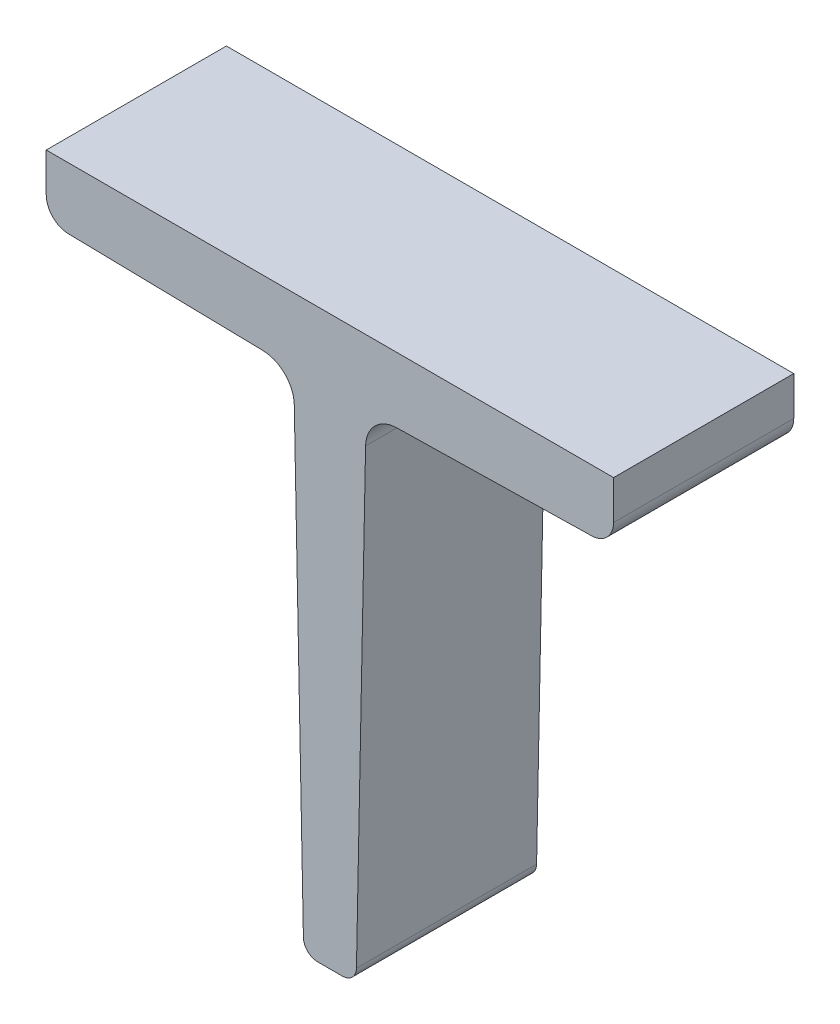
ISO-10303-21;
HEADER;
FILE_DESCRIPTION(('STEP AP214'),'2;1');
FILE_NAME('part.step','',(''),(''),'','','');
FILE_SCHEMA(('AUTOMOTIVE_DESIGN { 1 0 10303 214 1 1 1 1 }'));
ENDSEC;
DATA;
#1=APPLICATION_CONTEXT('core data for automotive mechanical design processes');
#2=APPLICATION_PROTOCOL_DEFINITION('international standard','automotive_design',2000,#1);
#3=PRODUCT_CONTEXT('',#1,'mechanical');
#4=PRODUCT('Part','Part','',(#3));
#5=PRODUCT_RELATED_PRODUCT_CATEGORY('part','',(#4));
#6=PRODUCT_DEFINITION_FORMATION('','',#4);
#7=PRODUCT_DEFINITION_CONTEXT('part definition',#1,'design');
#8=PRODUCT_DEFINITION('design','',#6,#7);
#9=PRODUCT_DEFINITION_SHAPE('','',#8);
#10=(LENGTH_UNIT() NAMED_UNIT(*) SI_UNIT(.MILLI.,.METRE.));
#11=(NAMED_UNIT(*) PLANE_ANGLE_UNIT() SI_UNIT($,.RADIAN.));
#12=(NAMED_UNIT(*) SI_UNIT($,.STERADIAN.) SOLID_ANGLE_UNIT());
#13=UNCERTAINTY_MEASURE_WITH_UNIT(LENGTH_MEASURE(1.E-05),#10,'distance_accuracy_value','');
#14=(GEOMETRIC_REPRESENTATION_CONTEXT(3) GLOBAL_UNCERTAINTY_ASSIGNED_CONTEXT((#13)) GLOBAL_UNIT_ASSIGNED_CONTEXT((#10,
#11,#12)) REPRESENTATION_CONTEXT('',''));
#15=CARTESIAN_POINT('',(0.,0.,0.));
#16=DIRECTION('',(0.,0.,1.));
#17=DIRECTION('',(1.,0.,0.));
#18=AXIS2_PLACEMENT_3D('',#15,#16,#17);
#19=CARTESIAN_POINT('',(0.,0.,12.7));
#20=DIRECTION('',(1.,0.,0.));
#21=DIRECTION('',(0.,1.,0.));
#22=AXIS2_PLACEMENT_3D('',#19,#20,#21);
#23=PLANE('',#22);
#24=DIRECTION('',(0.,-1.,0.));
#25=VECTOR('',#24,1.);
#26=CARTESIAN_POINT('',(0.,0.,-12.7));
#27=LINE('',#26,#25);
#28=CARTESIAN_POINT('',(0.,0.,-12.7));
#29=VERTEX_POINT('',#28);
#30=CARTESIAN_POINT('',(0.,-5.48779513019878,-12.7));
#31=VERTEX_POINT('',#30);
#32=EDGE_CURVE('E166',#29,#31,#27,.T.);
#33=ORIENTED_EDGE('',*,*,#32,.T.);
#34=DIRECTION('',(0.,0.,-1.));
#35=VECTOR('',#34,1.);
#36=CARTESIAN_POINT('',(0.,-5.48779513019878,12.7));
#37=LINE('',#36,#35);
#38=CARTESIAN_POINT('',(0.,-5.48779513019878,12.7));
#39=VERTEX_POINT('',#38);
#40=EDGE_CURVE('E212',#31,#39,#37,.F.);
#41=ORIENTED_EDGE('',*,*,#40,.T.);
#42=DIRECTION('',(0.,-1.,0.));
#43=VECTOR('',#42,1.);
#44=CARTESIAN_POINT('',(0.,0.,12.7));
#45=LINE('',#44,#43);
#46=CARTESIAN_POINT('',(0.,0.,12.7));
#47=VERTEX_POINT('',#46);
#48=EDGE_CURVE('E184',#47,#39,#45,.T.);
#49=ORIENTED_EDGE('',*,*,#48,.F.);
#50=DIRECTION('',(0.,0.,-1.));
#51=VECTOR('',#50,1.);
#52=CARTESIAN_POINT('',(0.,0.,12.7));
#53=LINE('',#52,#51);
#54=EDGE_CURVE('E149',#47,#29,#53,.T.);
#55=ORIENTED_EDGE('',*,*,#54,.T.);
#56=EDGE_LOOP('',(#33,#41,#49,#55));
#57=FACE_BOUND('',#56,.T.);
#58=ADVANCED_FACE('F32',(#57),#23,.F.);
#59=CARTESIAN_POINT('',(34.8858284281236,-9.29777820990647,12.7));
#60=DIRECTION('',(-0.0200001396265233,-0.9997999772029,0.));
#61=DIRECTION('',(0.9997999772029,-0.0200001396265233,0.));
#62=AXIS2_PLACEMENT_3D('',#59,#60,#61);
#63=PLANE('',#62);
#64=DIRECTION('',(-0.9997999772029,0.0200001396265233,0.));
#65=VECTOR('',#64,1.);
#66=CARTESIAN_POINT('',(34.8858284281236,-9.29777820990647,12.7));
#67=LINE('',#66,#65);
#68=CARTESIAN_POINT('',(30.5631996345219,-9.21130773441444,12.7));
#69=VERTEX_POINT('',#68);
#70=CARTESIAN_POINT('',(3.11149955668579,-8.66216005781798,12.7));
#71=VERTEX_POINT('',#70);
#72=EDGE_CURVE('E259',#69,#71,#67,.T.);
#73=ORIENTED_EDGE('',*,*,#72,.T.);
#74=DIRECTION('',(0.,0.,-1.));
#75=VECTOR('',#74,1.);
#76=CARTESIAN_POINT('',(3.11149955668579,-8.66216005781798,-12.7));
#77=LINE('',#76,#75);
#78=CARTESIAN_POINT('',(3.11149955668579,-8.66216005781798,-12.7));
#79=VERTEX_POINT('',#78);
#80=EDGE_CURVE('E205',#71,#79,#77,.T.);
#81=ORIENTED_EDGE('',*,*,#80,.T.);
#82=DIRECTION('',(-0.9997999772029,0.0200001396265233,0.));
#83=VECTOR('',#82,1.);
#84=CARTESIAN_POINT('',(34.8858284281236,-9.29777820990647,-12.7));
#85=LINE('',#84,#83);
#86=CARTESIAN_POINT('',(30.5631996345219,-9.21130773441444,-12.7));
#87=VERTEX_POINT('',#86);
#88=EDGE_CURVE('E169',#87,#79,#85,.T.);
#89=ORIENTED_EDGE('',*,*,#88,.F.);
#90=DIRECTION('',(0.,0.,-1.));
#91=VECTOR('',#90,1.);
#92=CARTESIAN_POINT('',(30.5631996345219,-9.21130773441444,12.7));
#93=LINE('',#92,#91);
#94=EDGE_CURVE('E188',#87,#69,#93,.F.);
#95=ORIENTED_EDGE('',*,*,#94,.T.);
#96=EDGE_LOOP('',(#73,#81,#89,#95));
#97=FACE_BOUND('',#96,.T.);
#98=ADVANCED_FACE('F256',(#97),#63,.T.);
#99=CARTESIAN_POINT('',(36.3001656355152,-80.,12.7));
#100=DIRECTION('',(-0.9997999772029,-0.0200001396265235,0.));
#101=DIRECTION('',(0.0200001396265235,-0.9997999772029,0.));
#102=AXIS2_PLACEMENT_3D('',#99,#100,#101);
#103=PLANE('',#102);
#104=DIRECTION('',(-0.0200001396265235,0.9997999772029,0.));
#105=VECTOR('',#104,1.);
#106=CARTESIAN_POINT('',(36.3001656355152,-80.,-12.7));
#107=LINE('',#106,#105);
#108=CARTESIAN_POINT('',(36.2609575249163,-78.0400002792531,-12.7));
#109=VERTEX_POINT('',#108);
#110=CARTESIAN_POINT('',(34.9722989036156,-13.6204070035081,-12.7));
#111=VERTEX_POINT('',#110);
#112=EDGE_CURVE('E172',#109,#111,#107,.T.);
#113=ORIENTED_EDGE('',*,*,#112,.F.);
#114=DIRECTION('',(0.,0.,-1.));
#115=VECTOR('',#114,1.);
#116=CARTESIAN_POINT('',(36.2609575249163,-78.0400002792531,12.7));
#117=LINE('',#116,#115);
#118=CARTESIAN_POINT('',(36.2609575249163,-78.0400002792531,12.7));
#119=VERTEX_POINT('',#118);
#120=EDGE_CURVE('E55',#109,#119,#117,.F.);
#121=ORIENTED_EDGE('',*,*,#120,.T.);
#122=DIRECTION('',(-0.0200001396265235,0.9997999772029,0.));
#123=VECTOR('',#122,1.);
#124=CARTESIAN_POINT('',(36.3001656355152,-80.,12.7));
#125=LINE('',#124,#123);
#126=CARTESIAN_POINT('',(34.9722989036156,-13.6204070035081,12.7));
#127=VERTEX_POINT('',#126);
#128=EDGE_CURVE('E234',#119,#127,#125,.T.);
#129=ORIENTED_EDGE('',*,*,#128,.T.);
#130=DIRECTION('',(0.,0.,-1.));
#131=VECTOR('',#130,1.);
#132=CARTESIAN_POINT('',(34.9722989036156,-13.6204070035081,-12.7));
#133=LINE('',#132,#131);
#134=EDGE_CURVE('E148',#127,#111,#133,.T.);
#135=ORIENTED_EDGE('',*,*,#134,.T.);
#136=EDGE_LOOP('',(#113,#121,#129,#135));
#137=FACE_BOUND('',#136,.T.);
#138=ADVANCED_FACE('F247',(#137),#103,.T.);
#139=CARTESIAN_POINT('',(36.3001656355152,-80.,12.7));
#140=DIRECTION('',(0.,1.,0.));
#141=DIRECTION('',(0.,0.,1.));
#142=AXIS2_PLACEMENT_3D('',#139,#140,#141);
#143=PLANE('',#142);
#144=DIRECTION('',(1.,0.,0.));
#145=VECTOR('',#144,1.);
#146=CARTESIAN_POINT('',(36.3001656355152,-80.,12.7));
#147=LINE('',#146,#145);
#148=CARTESIAN_POINT('',(38.2605574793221,-80.,12.7));
#149=VERTEX_POINT('',#148);
#150=CARTESIAN_POINT('',(41.7394425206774,-80.,12.7));
#151=VERTEX_POINT('',#150);
#152=EDGE_CURVE('E233',#149,#151,#147,.T.);
#153=ORIENTED_EDGE('',*,*,#152,.F.);
#154=DIRECTION('',(0.,0.,-1.));
#155=VECTOR('',#154,1.);
#156=CARTESIAN_POINT('',(38.2605574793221,-80.,-12.7));
#157=LINE('',#156,#155);
#158=CARTESIAN_POINT('',(38.2605574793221,-80.,-12.7));
#159=VERTEX_POINT('',#158);
#160=EDGE_CURVE('E223',#149,#159,#157,.T.);
#161=ORIENTED_EDGE('',*,*,#160,.T.);
#162=DIRECTION('',(1.,0.,0.));
#163=VECTOR('',#162,1.);
#164=CARTESIAN_POINT('',(36.3001656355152,-80.,-12.7));
#165=LINE('',#164,#163);
#166=CARTESIAN_POINT('',(41.7394425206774,-80.,-12.7));
#167=VERTEX_POINT('',#166);
#168=EDGE_CURVE('E174',#159,#167,#165,.T.);
#169=ORIENTED_EDGE('',*,*,#168,.T.);
#170=DIRECTION('',(0.,0.,-1.));
#171=VECTOR('',#170,1.);
#172=CARTESIAN_POINT('',(41.7394425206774,-80.,12.7));
#173=LINE('',#172,#171);
#174=EDGE_CURVE('E221',#167,#151,#173,.F.);
#175=ORIENTED_EDGE('',*,*,#174,.T.);
#176=EDGE_LOOP('',(#153,#161,#169,#175));
#177=FACE_BOUND('',#176,.T.);
#178=ADVANCED_FACE('F238',(#177),#143,.F.);
#179=CARTESIAN_POINT('',(45.1141715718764,-9.29777820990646,12.7));
#180=DIRECTION('',(0.9997999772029,-0.0200001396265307,0.));
#181=DIRECTION('',(0.0200001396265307,0.9997999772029,0.));
#182=AXIS2_PLACEMENT_3D('',#179,#180,#181);
#183=PLANE('',#182);
#184=DIRECTION('',(-0.0200001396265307,-0.9997999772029,0.));
#185=VECTOR('',#184,1.);
#186=CARTESIAN_POINT('',(45.1141715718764,-9.29777820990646,12.7));
#187=LINE('',#186,#185);
#188=CARTESIAN_POINT('',(45.0277010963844,-13.6204070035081,12.7));
#189=VERTEX_POINT('',#188);
#190=CARTESIAN_POINT('',(43.7390424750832,-78.0400002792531,12.7));
#191=VERTEX_POINT('',#190);
#192=EDGE_CURVE('E241',#189,#191,#187,.T.);
#193=ORIENTED_EDGE('',*,*,#192,.T.);
#194=DIRECTION('',(0.,0.,-1.));
#195=VECTOR('',#194,1.);
#196=CARTESIAN_POINT('',(43.7390424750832,-78.0400002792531,-12.7));
#197=LINE('',#196,#195);
#198=CARTESIAN_POINT('',(43.7390424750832,-78.0400002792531,-12.7));
#199=VERTEX_POINT('',#198);
#200=EDGE_CURVE('E11',#191,#199,#197,.T.);
#201=ORIENTED_EDGE('',*,*,#200,.T.);
#202=DIRECTION('',(-0.0200001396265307,-0.9997999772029,0.));
#203=VECTOR('',#202,1.);
#204=CARTESIAN_POINT('',(45.1141715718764,-9.29777820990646,-12.7));
#205=LINE('',#204,#203);
#206=CARTESIAN_POINT('',(45.0277010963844,-13.6204070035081,-12.7));
#207=VERTEX_POINT('',#206);
#208=EDGE_CURVE('E177',#207,#199,#205,.T.);
#209=ORIENTED_EDGE('',*,*,#208,.F.);
#210=DIRECTION('',(0.,0.,-1.));
#211=VECTOR('',#210,1.);
#212=CARTESIAN_POINT('',(45.0277010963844,-13.6204070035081,12.7));
#213=LINE('',#212,#211);
#214=EDGE_CURVE('E193',#207,#189,#213,.F.);
#215=ORIENTED_EDGE('',*,*,#214,.T.);
#216=EDGE_LOOP('',(#193,#201,#209,#215));
#217=FACE_BOUND('',#216,.T.);
#218=ADVANCED_FACE('F282',(#217),#183,.T.);
#219=CARTESIAN_POINT('',(80.,-8.59991718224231,12.7));
#220=DIRECTION('',(0.0200001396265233,-0.9997999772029,0.));
#221=DIRECTION('',(0.9997999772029,0.0200001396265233,0.));
#222=AXIS2_PLACEMENT_3D('',#219,#220,#221);
#223=PLANE('',#222);
#224=DIRECTION('',(-0.9997999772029,-0.0200001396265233,0.));
#225=VECTOR('',#224,1.);
#226=CARTESIAN_POINT('',(80.,-8.59991718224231,-12.7));
#227=LINE('',#226,#225);
#228=CARTESIAN_POINT('',(76.8885004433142,-8.66216005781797,-12.7));
#229=VERTEX_POINT('',#228);
#230=CARTESIAN_POINT('',(49.4368003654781,-9.21130773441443,-12.7));
#231=VERTEX_POINT('',#230);
#232=EDGE_CURVE('E180',#229,#231,#227,.T.);
#233=ORIENTED_EDGE('',*,*,#232,.F.);
#234=DIRECTION('',(0.,0.,-1.));
#235=VECTOR('',#234,1.);
#236=CARTESIAN_POINT('',(76.8885004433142,-8.66216005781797,12.7));
#237=LINE('',#236,#235);
#238=CARTESIAN_POINT('',(76.8885004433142,-8.66216005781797,12.7));
#239=VERTEX_POINT('',#238);
#240=EDGE_CURVE('E219',#229,#239,#237,.F.);
#241=ORIENTED_EDGE('',*,*,#240,.T.);
#242=DIRECTION('',(-0.9997999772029,-0.0200001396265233,0.));
#243=VECTOR('',#242,1.);
#244=CARTESIAN_POINT('',(80.,-8.59991718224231,12.7));
#245=LINE('',#244,#243);
#246=CARTESIAN_POINT('',(49.4368003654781,-9.21130773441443,12.7));
#247=VERTEX_POINT('',#246);
#248=EDGE_CURVE('E158',#239,#247,#245,.T.);
#249=ORIENTED_EDGE('',*,*,#248,.T.);
#250=DIRECTION('',(0.,0.,-1.));
#251=VECTOR('',#250,1.);
#252=CARTESIAN_POINT('',(49.4368003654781,-9.21130773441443,-12.7));
#253=LINE('',#252,#251);
#254=EDGE_CURVE('E190',#247,#231,#253,.T.);
#255=ORIENTED_EDGE('',*,*,#254,.T.);
#256=EDGE_LOOP('',(#233,#241,#249,#255));
#257=FACE_BOUND('',#256,.T.);
#258=ADVANCED_FACE('F272',(#257),#223,.T.);
#259=CARTESIAN_POINT('',(80.,0.,12.7));
#260=DIRECTION('',(1.,0.,0.));
#261=DIRECTION('',(0.,1.,0.));
#262=AXIS2_PLACEMENT_3D('',#259,#260,#261);
#263=PLANE('',#262);
#264=DIRECTION('',(0.,-1.,0.));
#265=VECTOR('',#264,1.);
#266=CARTESIAN_POINT('',(80.,0.,12.7));
#267=LINE('',#266,#265);
#268=CARTESIAN_POINT('',(80.,0.,12.7));
#269=VERTEX_POINT('',#268);
#270=CARTESIAN_POINT('',(80.,-5.48779513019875,12.7));
#271=VERTEX_POINT('',#270);
#272=EDGE_CURVE('E140',#269,#271,#267,.T.);
#273=ORIENTED_EDGE('',*,*,#272,.T.);
#274=DIRECTION('',(0.,0.,-1.));
#275=VECTOR('',#274,1.);
#276=CARTESIAN_POINT('',(80.,-5.48779513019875,12.7));
#277=LINE('',#276,#275);
#278=CARTESIAN_POINT('',(80.,-5.48779513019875,-12.7));
#279=VERTEX_POINT('',#278);
#280=EDGE_CURVE('E217',#271,#279,#277,.T.);
#281=ORIENTED_EDGE('',*,*,#280,.T.);
#282=DIRECTION('',(0.,-1.,0.));
#283=VECTOR('',#282,1.);
#284=CARTESIAN_POINT('',(80.,0.,-12.7));
#285=LINE('',#284,#283);
#286=CARTESIAN_POINT('',(80.,0.,-12.7));
#287=VERTEX_POINT('',#286);
#288=EDGE_CURVE('E143',#287,#279,#285,.T.);
#289=ORIENTED_EDGE('',*,*,#288,.F.);
#290=DIRECTION('',(0.,0.,-1.));
#291=VECTOR('',#290,1.);
#292=CARTESIAN_POINT('',(80.,0.,12.7));
#293=LINE('',#292,#291);
#294=EDGE_CURVE('E136',#269,#287,#293,.T.);
#295=ORIENTED_EDGE('',*,*,#294,.F.);
#296=EDGE_LOOP('',(#273,#281,#289,#295));
#297=FACE_BOUND('',#296,.T.);
#298=ADVANCED_FACE('F138',(#297),#263,.T.);
#299=CARTESIAN_POINT('',(0.,0.,12.7));
#300=DIRECTION('',(0.,1.,0.));
#301=DIRECTION('',(-1.,0.,0.));
#302=AXIS2_PLACEMENT_3D('',#299,#300,#301);
#303=PLANE('',#302);
#304=DIRECTION('',(1.,0.,0.));
#305=VECTOR('',#304,1.);
#306=CARTESIAN_POINT('',(0.,0.,-12.7));
#307=LINE('',#306,#305);
#308=EDGE_CURVE('E183',#29,#287,#307,.T.);
#309=ORIENTED_EDGE('',*,*,#308,.F.);
#310=ORIENTED_EDGE('',*,*,#54,.F.);
#311=DIRECTION('',(1.,0.,0.));
#312=VECTOR('',#311,1.);
#313=CARTESIAN_POINT('',(0.,0.,12.7));
#314=LINE('',#313,#312);
#315=EDGE_CURVE('E154',#47,#269,#314,.T.);
#316=ORIENTED_EDGE('',*,*,#315,.T.);
#317=ORIENTED_EDGE('',*,*,#294,.T.);
#318=EDGE_LOOP('',(#309,#310,#316,#317));
#319=FACE_BOUND('',#318,.T.);
#320=ADVANCED_FACE('F160',(#319),#303,.T.);
#321=CARTESIAN_POINT('',(0.,0.,12.7));
#322=DIRECTION('',(0.,0.,1.));
#323=DIRECTION('',(1.,0.,0.));
#324=AXIS2_PLACEMENT_3D('',#321,#322,#323);
#325=PLANE('',#324);
#326=ORIENTED_EDGE('',*,*,#128,.F.);
#327=CARTESIAN_POINT('',(38.2605574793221,-78.,12.7));
#328=DIRECTION('',(0.,0.,1.));
#329=DIRECTION('',(1.,0.,0.));
#330=AXIS2_PLACEMENT_3D('',#327,#328,#329);
#331=CIRCLE('',#330,2.);
#332=EDGE_CURVE('E40',#119,#149,#331,.T.);
#333=ORIENTED_EDGE('',*,*,#332,.T.);
#334=ORIENTED_EDGE('',*,*,#152,.T.);
#335=CARTESIAN_POINT('',(41.7394425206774,-78.,12.7));
#336=DIRECTION('',(0.,0.,1.));
#337=DIRECTION('',(1.,0.,0.));
#338=AXIS2_PLACEMENT_3D('',#335,#336,#337);
#339=CIRCLE('',#338,2.);
#340=EDGE_CURVE('E47',#151,#191,#339,.T.);
#341=ORIENTED_EDGE('',*,*,#340,.T.);
#342=ORIENTED_EDGE('',*,*,#192,.F.);
#343=CARTESIAN_POINT('',(49.5268009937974,-13.7104076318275,12.7));
#344=DIRECTION('',(0.,0.,1.));
#345=DIRECTION('',(1.,0.,0.));
#346=AXIS2_PLACEMENT_3D('',#343,#344,#345);
#347=CIRCLE('',#346,4.5);
#348=EDGE_CURVE('E202',#189,#247,#347,.F.);
#349=ORIENTED_EDGE('',*,*,#348,.T.);
#350=ORIENTED_EDGE('',*,*,#248,.F.);
#351=CARTESIAN_POINT('',(76.825,-5.48779513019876,12.7));
#352=DIRECTION('',(0.,0.,1.));
#353=DIRECTION('',(1.,0.,0.));
#354=AXIS2_PLACEMENT_3D('',#351,#352,#353);
#355=CIRCLE('',#354,3.175);
#356=EDGE_CURVE('E157',#239,#271,#355,.T.);
#357=ORIENTED_EDGE('',*,*,#356,.T.);
#358=ORIENTED_EDGE('',*,*,#272,.F.);
#359=ORIENTED_EDGE('',*,*,#315,.F.);
#360=ORIENTED_EDGE('',*,*,#48,.T.);
#361=CARTESIAN_POINT('',(3.175,-5.48779513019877,12.7));
#362=DIRECTION('',(0.,0.,1.));
#363=DIRECTION('',(1.,0.,0.));
#364=AXIS2_PLACEMENT_3D('',#361,#362,#363);
#365=CIRCLE('',#364,3.175);
#366=EDGE_CURVE('E215',#39,#71,#365,.T.);
#367=ORIENTED_EDGE('',*,*,#366,.T.);
#368=ORIENTED_EDGE('',*,*,#72,.F.);
#369=CARTESIAN_POINT('',(30.4731990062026,-13.7104076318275,12.7));
#370=DIRECTION('',(0.,0.,1.));
#371=DIRECTION('',(1.,0.,0.));
#372=AXIS2_PLACEMENT_3D('',#369,#370,#371);
#373=CIRCLE('',#372,4.5);
#374=EDGE_CURVE('E197',#69,#127,#373,.F.);
#375=ORIENTED_EDGE('',*,*,#374,.T.);
#376=EDGE_LOOP('',(#326,#333,#334,#341,#342,#349,#350,#357,#358,#359,#360,#367,#368,#375));
#377=FACE_BOUND('',#376,.T.);
#378=ADVANCED_FACE('F152',(#377),#325,.T.);
#379=CARTESIAN_POINT('',(0.,0.,-12.7));
#380=DIRECTION('',(0.,0.,1.));
#381=DIRECTION('',(1.,0.,0.));
#382=AXIS2_PLACEMENT_3D('',#379,#380,#381);
#383=PLANE('',#382);
#384=ORIENTED_EDGE('',*,*,#168,.F.);
#385=CARTESIAN_POINT('',(38.2605574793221,-78.,-12.7));
#386=DIRECTION('',(0.,0.,1.));
#387=DIRECTION('',(1.,0.,0.));
#388=AXIS2_PLACEMENT_3D('',#385,#386,#387);
#389=CIRCLE('',#388,2.);
#390=EDGE_CURVE('E228',#159,#109,#389,.F.);
#391=ORIENTED_EDGE('',*,*,#390,.T.);
#392=ORIENTED_EDGE('',*,*,#112,.T.);
#393=CARTESIAN_POINT('',(30.4731990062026,-13.7104076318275,-12.7));
#394=DIRECTION('',(0.,0.,1.));
#395=DIRECTION('',(1.,0.,0.));
#396=AXIS2_PLACEMENT_3D('',#393,#394,#395);
#397=CIRCLE('',#396,4.5);
#398=EDGE_CURVE('E195',#111,#87,#397,.T.);
#399=ORIENTED_EDGE('',*,*,#398,.T.);
#400=ORIENTED_EDGE('',*,*,#88,.T.);
#401=CARTESIAN_POINT('',(3.175,-5.48779513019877,-12.7));
#402=DIRECTION('',(0.,0.,1.));
#403=DIRECTION('',(1.,0.,0.));
#404=AXIS2_PLACEMENT_3D('',#401,#402,#403);
#405=CIRCLE('',#404,3.175);
#406=EDGE_CURVE('E210',#79,#31,#405,.F.);
#407=ORIENTED_EDGE('',*,*,#406,.T.);
#408=ORIENTED_EDGE('',*,*,#32,.F.);
#409=ORIENTED_EDGE('',*,*,#308,.T.);
#410=ORIENTED_EDGE('',*,*,#288,.T.);
#411=CARTESIAN_POINT('',(76.825,-5.48779513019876,-12.7));
#412=DIRECTION('',(0.,0.,1.));
#413=DIRECTION('',(1.,0.,0.));
#414=AXIS2_PLACEMENT_3D('',#411,#412,#413);
#415=CIRCLE('',#414,3.175);
#416=EDGE_CURVE('E208',#279,#229,#415,.F.);
#417=ORIENTED_EDGE('',*,*,#416,.T.);
#418=ORIENTED_EDGE('',*,*,#232,.T.);
#419=CARTESIAN_POINT('',(49.5268009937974,-13.7104076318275,-12.7));
#420=DIRECTION('',(0.,0.,1.));
#421=DIRECTION('',(1.,0.,0.));
#422=AXIS2_PLACEMENT_3D('',#419,#420,#421);
#423=CIRCLE('',#422,4.5);
#424=EDGE_CURVE('E200',#231,#207,#423,.T.);
#425=ORIENTED_EDGE('',*,*,#424,.T.);
#426=ORIENTED_EDGE('',*,*,#208,.T.);
#427=CARTESIAN_POINT('',(41.7394425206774,-78.,-12.7));
#428=DIRECTION('',(0.,0.,1.));
#429=DIRECTION('',(1.,0.,0.));
#430=AXIS2_PLACEMENT_3D('',#427,#428,#429);
#431=CIRCLE('',#430,2.);
#432=EDGE_CURVE('E226',#199,#167,#431,.F.);
#433=ORIENTED_EDGE('',*,*,#432,.T.);
#434=EDGE_LOOP('',(#384,#391,#392,#399,#400,#407,#408,#409,#410,#417,#418,#425,#426,#433));
#435=FACE_BOUND('',#434,.T.);
#436=ADVANCED_FACE('F245',(#435),#383,.F.);
#437=CARTESIAN_POINT('',(30.4731990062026,-13.7104076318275,12.7));
#438=DIRECTION('',(0.,0.,1.));
#439=DIRECTION('',(1.,0.,0.));
#440=AXIS2_PLACEMENT_3D('',#437,#438,#439);
#441=CYLINDRICAL_SURFACE('',#440,4.5);
#442=ORIENTED_EDGE('',*,*,#374,.F.);
#443=ORIENTED_EDGE('',*,*,#94,.F.);
#444=ORIENTED_EDGE('',*,*,#398,.F.);
#445=ORIENTED_EDGE('',*,*,#134,.F.);
#446=EDGE_LOOP('',(#442,#443,#444,#445));
#447=FACE_BOUND('',#446,.T.);
#448=ADVANCED_FACE('F251',(#447),#441,.F.);
#449=CARTESIAN_POINT('',(49.5268009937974,-13.7104076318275,12.7));
#450=DIRECTION('',(0.,0.,1.));
#451=DIRECTION('',(1.,0.,0.));
#452=AXIS2_PLACEMENT_3D('',#449,#450,#451);
#453=CYLINDRICAL_SURFACE('',#452,4.5);
#454=ORIENTED_EDGE('',*,*,#348,.F.);
#455=ORIENTED_EDGE('',*,*,#214,.F.);
#456=ORIENTED_EDGE('',*,*,#424,.F.);
#457=ORIENTED_EDGE('',*,*,#254,.F.);
#458=EDGE_LOOP('',(#454,#455,#456,#457));
#459=FACE_BOUND('',#458,.T.);
#460=ADVANCED_FACE('F279',(#459),#453,.F.);
#461=CARTESIAN_POINT('',(3.175,-5.48779513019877,12.7));
#462=DIRECTION('',(0.,0.,1.));
#463=DIRECTION('',(1.,0.,0.));
#464=AXIS2_PLACEMENT_3D('',#461,#462,#463);
#465=CYLINDRICAL_SURFACE('',#464,3.175);
#466=ORIENTED_EDGE('',*,*,#366,.F.);
#467=ORIENTED_EDGE('',*,*,#40,.F.);
#468=ORIENTED_EDGE('',*,*,#406,.F.);
#469=ORIENTED_EDGE('',*,*,#80,.F.);
#470=EDGE_LOOP('',(#466,#467,#468,#469));
#471=FACE_BOUND('',#470,.T.);
#472=ADVANCED_FACE('F262',(#471),#465,.T.);
#473=CARTESIAN_POINT('',(76.825,-5.48779513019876,12.7));
#474=DIRECTION('',(0.,0.,-1.));
#475=DIRECTION('',(-1.,0.,0.));
#476=AXIS2_PLACEMENT_3D('',#473,#474,#475);
#477=CYLINDRICAL_SURFACE('',#476,3.175);
#478=ORIENTED_EDGE('',*,*,#356,.F.);
#479=ORIENTED_EDGE('',*,*,#240,.F.);
#480=ORIENTED_EDGE('',*,*,#416,.F.);
#481=ORIENTED_EDGE('',*,*,#280,.F.);
#482=EDGE_LOOP('',(#478,#479,#480,#481));
#483=FACE_BOUND('',#482,.T.);
#484=ADVANCED_FACE('F289',(#483),#477,.T.);
#485=CARTESIAN_POINT('',(38.2605574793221,-78.,12.7));
#486=DIRECTION('',(0.,0.,1.));
#487=DIRECTION('',(1.,0.,0.));
#488=AXIS2_PLACEMENT_3D('',#485,#486,#487);
#489=CYLINDRICAL_SURFACE('',#488,2.);
#490=ORIENTED_EDGE('',*,*,#332,.F.);
#491=ORIENTED_EDGE('',*,*,#120,.F.);
#492=ORIENTED_EDGE('',*,*,#390,.F.);
#493=ORIENTED_EDGE('',*,*,#160,.F.);
#494=EDGE_LOOP('',(#490,#491,#492,#493));
#495=FACE_BOUND('',#494,.T.);
#496=ADVANCED_FACE('F243',(#495),#489,.T.);
#497=CARTESIAN_POINT('',(41.7394425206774,-78.,12.7));
#498=DIRECTION('',(0.,0.,1.));
#499=DIRECTION('',(1.,0.,0.));
#500=AXIS2_PLACEMENT_3D('',#497,#498,#499);
#501=CYLINDRICAL_SURFACE('',#500,2.);
#502=ORIENTED_EDGE('',*,*,#340,.F.);
#503=ORIENTED_EDGE('',*,*,#174,.F.);
#504=ORIENTED_EDGE('',*,*,#432,.F.);
#505=ORIENTED_EDGE('',*,*,#200,.F.);
#506=EDGE_LOOP('',(#502,#503,#504,#505));
#507=FACE_BOUND('',#506,.T.);
#508=ADVANCED_FACE('F34',(#507),#501,.T.);
#509=CLOSED_SHELL('',(#58,#98,#138,#178,#218,#258,#298,#320,#378,#436,#448,#460,#472,#484,#496,#508));
#510=MANIFOLD_SOLID_BREP('B2',#509);
#511=ADVANCED_BREP_SHAPE_REPRESENTATION('',(#18,#510),#14);
#512=SHAPE_DEFINITION_REPRESENTATION(#9,#511);
ENDSEC;
END-ISO-10303-21;
